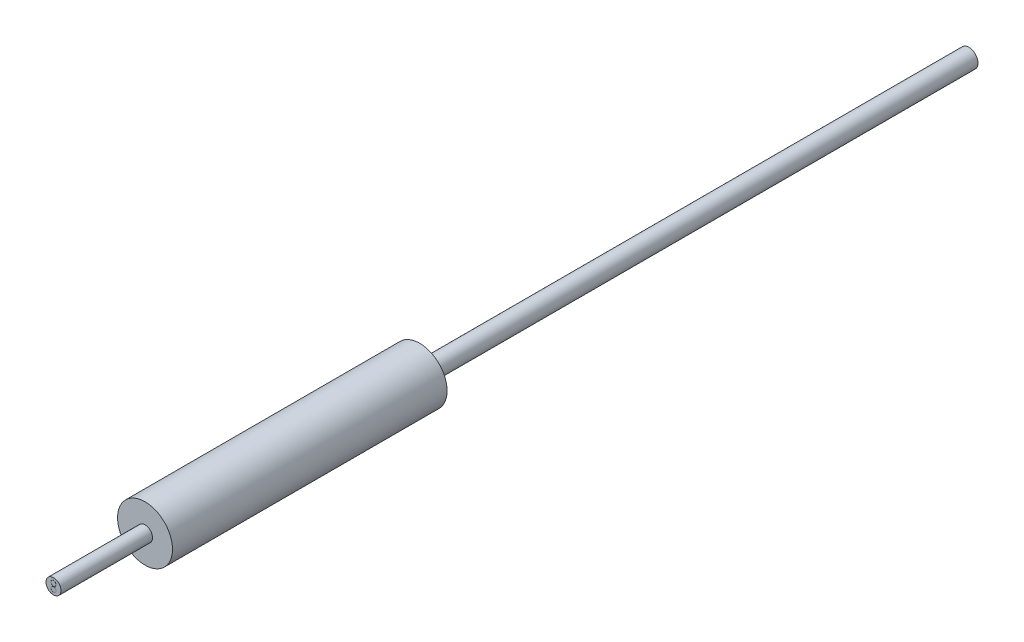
from build123d import *

# Parameters (mm, degrees)
SKETCH_1_R          = 1.5
EXTRUDE_1_DEPTH     = 15
SKETCH_9_R          = 0.5
EXTRUDE_2_DEPTH     = 30
SKETCH_10_R         = 0.41
EXTRUDE_3_DEPTH     = 5
SKETCH_11_R         = 0.1375
SKETCH_11_R_2       = 0.1325
CUT_EXTRUDE_1_DEPTH = 0.1


with BuildPart() as part:
    # Sketch 1 → Extrude 1 (new body)
    with BuildSketch(Plane.XY):
        Circle(SKETCH_1_R)
    extrude(amount=-EXTRUDE_1_DEPTH)

    # Sketch 9 → Extrude 2 (add)
    with BuildSketch(Plane(origin=(0, 0, -15), x_dir=(-1, 0, 0), z_dir=(0, 0, -1))):
        Circle(SKETCH_9_R)
    extrude(amount=EXTRUDE_2_DEPTH)

    # Sketch 10 → Extrude 3 (add)
    with BuildSketch(Plane.XY):
        Circle(SKETCH_10_R)
    extrude(amount=EXTRUDE_3_DEPTH)

    # Sketch 11 → Cut-Extrude 1 (cut)
    # profile 1 of 2: a face of its own
    with BuildSketch(Plane.XY.offset(5)):
        with Locations((0, 0.1475)):
            Circle(SKETCH_11_R)
        with Locations((0, 0.1475)):
            Circle(SKETCH_11_R_2, mode=Mode.SUBTRACT)
    # profile 2 of 2: a face of its own
    with BuildSketch(Plane.XY.offset(5)):
        with Locations((0, -0.1475)):
            Circle(SKETCH_11_R)
        with Locations((0, -0.1475)):
            Circle(SKETCH_11_R_2, mode=Mode.SUBTRACT)
    extrude(amount=-CUT_EXTRUDE_1_DEPTH, mode=Mode.SUBTRACT)


solid = part.part
